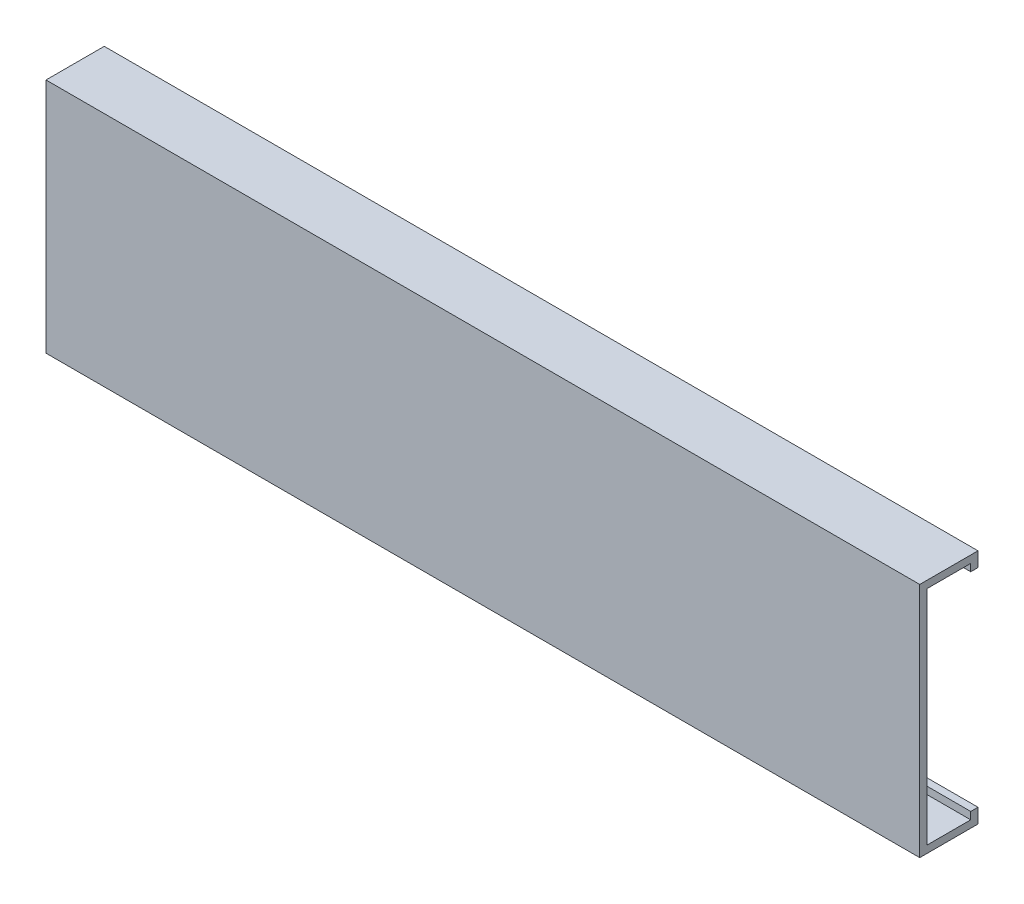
from build123d import *

# Parameters (mm, degrees)
SKETCH1_W           = 120
SKETCH1_H           = 31.5
BOSS_EXTRUDE1_DEPTH = 1
SKETCH2_W           = 120
SKETCH2_H           = 7
BOSS_EXTRUDE2_DEPTH = 1
SKETCH3_W           = 120
SKETCH3_H           = 1
BOSS_EXTRUDE3_DEPTH = 1
SKETCH4_W           = 120
SKETCH4_H           = 8
BOSS_EXTRUDE4_DEPTH = 1
SKETCH6_W           = 120
SKETCH6_H           = 1
BOSS_EXTRUDE5_DEPTH = 1


with BuildPart() as part:
    # Sketch1 → Boss-Extrude1 (new body)
    with BuildSketch(Plane.XY):
        Rectangle(SKETCH1_W, SKETCH1_H)
    extrude(amount=BOSS_EXTRUDE1_DEPTH)

    # Sketch2 → Boss-Extrude2 (add)
    with BuildSketch(Plane(origin=(0, 15.75, 0), x_dir=(1, 0, 0), z_dir=(0, 1, 0))):
        with Locations((0, 3.5)):
            Rectangle(SKETCH2_W, SKETCH2_H)
    extrude(amount=-BOSS_EXTRUDE2_DEPTH)

    # Sketch3 → Boss-Extrude3 (add)
    with BuildSketch(Plane.XZ.offset(-14.75)):
        with Locations((0, -6.5)):
            Rectangle(SKETCH3_W, SKETCH3_H)
    extrude(amount=BOSS_EXTRUDE3_DEPTH)

    # Sketch4 → Boss-Extrude4 (add)
    with BuildSketch(Plane.XZ.offset(15.75)):
        with Locations((0, -3)):
            Rectangle(SKETCH4_W, SKETCH4_H)
    extrude(amount=BOSS_EXTRUDE4_DEPTH)

    # Sketch6 → Boss-Extrude5 (add)
    with BuildSketch(Plane(origin=(0, -15.75, 0), x_dir=(1, 0, 0), z_dir=(0, 1, 0))):
        with Locations((0, 6.5)):
            Rectangle(SKETCH6_W, SKETCH6_H)
    extrude(amount=BOSS_EXTRUDE5_DEPTH)


solid = part.part
